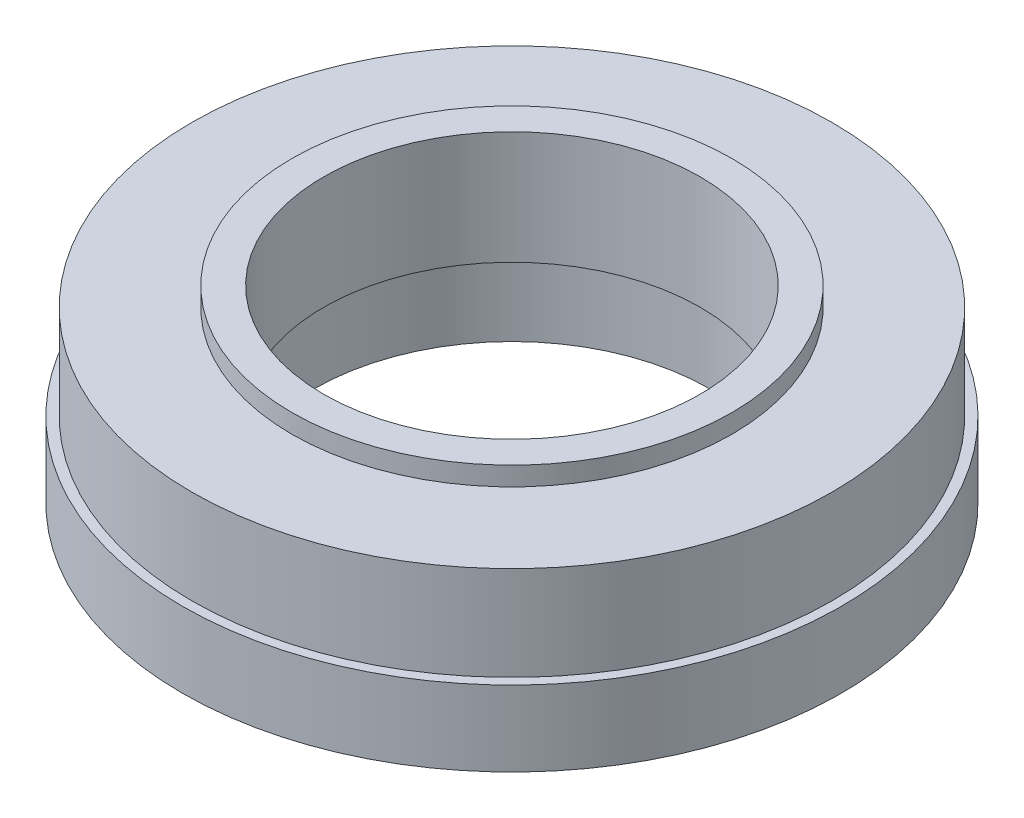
ISO-10303-21;
HEADER;
FILE_DESCRIPTION(('STEP AP214'),'2;1');
FILE_NAME('part.step','',(''),(''),'','','');
FILE_SCHEMA(('AUTOMOTIVE_DESIGN { 1 0 10303 214 1 1 1 1 }'));
ENDSEC;
DATA;
#1=APPLICATION_CONTEXT('core data for automotive mechanical design processes');
#2=APPLICATION_PROTOCOL_DEFINITION('international standard','automotive_design',2000,#1);
#3=PRODUCT_CONTEXT('',#1,'mechanical');
#4=PRODUCT('Part','Part','',(#3));
#5=PRODUCT_RELATED_PRODUCT_CATEGORY('part','',(#4));
#6=PRODUCT_DEFINITION_FORMATION('','',#4);
#7=PRODUCT_DEFINITION_CONTEXT('part definition',#1,'design');
#8=PRODUCT_DEFINITION('design','',#6,#7);
#9=PRODUCT_DEFINITION_SHAPE('','',#8);
#10=(LENGTH_UNIT() NAMED_UNIT(*) SI_UNIT(.MILLI.,.METRE.));
#11=(NAMED_UNIT(*) PLANE_ANGLE_UNIT() SI_UNIT($,.RADIAN.));
#12=(NAMED_UNIT(*) SI_UNIT($,.STERADIAN.) SOLID_ANGLE_UNIT());
#13=UNCERTAINTY_MEASURE_WITH_UNIT(LENGTH_MEASURE(1.E-05),#10,'distance_accuracy_value','');
#14=(GEOMETRIC_REPRESENTATION_CONTEXT(3) GLOBAL_UNCERTAINTY_ASSIGNED_CONTEXT((#13)) GLOBAL_UNIT_ASSIGNED_CONTEXT((#10,
#11,#12)) REPRESENTATION_CONTEXT('',''));
#15=CARTESIAN_POINT('',(0.,0.,0.));
#16=DIRECTION('',(0.,0.,1.));
#17=DIRECTION('',(1.,0.,0.));
#18=AXIS2_PLACEMENT_3D('',#15,#16,#17);
#19=CARTESIAN_POINT('',(0.,9.,0.));
#20=DIRECTION('',(0.,1.,0.));
#21=DIRECTION('',(0.,0.,1.));
#22=AXIS2_PLACEMENT_3D('',#19,#20,#21);
#23=PLANE('',#22);
#24=CARTESIAN_POINT('',(0.,9.,0.));
#25=DIRECTION('',(0.,1.,0.));
#26=DIRECTION('',(0.,0.,1.));
#27=AXIS2_PLACEMENT_3D('',#24,#25,#26);
#28=CIRCLE('',#27,17.);
#29=CARTESIAN_POINT('',(0.,9.,17.));
#30=VERTEX_POINT('',#29);
#31=EDGE_CURVE('E60',#30,#30,#28,.T.);
#32=ORIENTED_EDGE('',*,*,#31,.T.);
#33=EDGE_LOOP('',(#32));
#34=FACE_BOUND('',#33,.T.);
#35=CARTESIAN_POINT('',(0.,9.,0.));
#36=DIRECTION('',(0.,1.,0.));
#37=DIRECTION('',(0.,0.,1.));
#38=AXIS2_PLACEMENT_3D('',#35,#36,#37);
#39=CIRCLE('',#38,11.684);
#40=CARTESIAN_POINT('',(0.,9.,11.684));
#41=VERTEX_POINT('',#40);
#42=EDGE_CURVE('E66',#41,#41,#39,.T.);
#43=ORIENTED_EDGE('',*,*,#42,.F.);
#44=EDGE_LOOP('',(#43));
#45=FACE_BOUND('',#44,.T.);
#46=ADVANCED_FACE('F34',(#34,#45),#23,.T.);
#47=CARTESIAN_POINT('',(0.,4.,0.));
#48=DIRECTION('',(0.,1.,0.));
#49=DIRECTION('',(0.,0.,1.));
#50=AXIS2_PLACEMENT_3D('',#47,#48,#49);
#51=PLANE('',#50);
#52=CARTESIAN_POINT('',(0.,4.,0.));
#53=DIRECTION('',(0.,1.,0.));
#54=DIRECTION('',(0.,0.,1.));
#55=AXIS2_PLACEMENT_3D('',#52,#53,#54);
#56=CIRCLE('',#55,17.5);
#57=CARTESIAN_POINT('',(0.,4.,17.5));
#58=VERTEX_POINT('',#57);
#59=EDGE_CURVE('E10',#58,#58,#56,.T.);
#60=ORIENTED_EDGE('',*,*,#59,.T.);
#61=EDGE_LOOP('',(#60));
#62=FACE_BOUND('',#61,.T.);
#63=CARTESIAN_POINT('',(0.,4.,0.));
#64=DIRECTION('',(0.,1.,0.));
#65=DIRECTION('',(0.,0.,1.));
#66=AXIS2_PLACEMENT_3D('',#63,#64,#65);
#67=CIRCLE('',#66,17.);
#68=CARTESIAN_POINT('',(0.,4.,17.));
#69=VERTEX_POINT('',#68);
#70=EDGE_CURVE('E54',#69,#69,#67,.T.);
#71=ORIENTED_EDGE('',*,*,#70,.F.);
#72=EDGE_LOOP('',(#71));
#73=FACE_BOUND('',#72,.T.);
#74=ADVANCED_FACE('F90',(#62,#73),#51,.T.);
#75=CARTESIAN_POINT('',(0.,0.,0.));
#76=DIRECTION('',(0.,1.,0.));
#77=DIRECTION('',(0.,0.,1.));
#78=AXIS2_PLACEMENT_3D('',#75,#76,#77);
#79=PLANE('',#78);
#80=CARTESIAN_POINT('',(0.,0.,0.));
#81=DIRECTION('',(0.,1.,0.));
#82=DIRECTION('',(0.,0.,1.));
#83=AXIS2_PLACEMENT_3D('',#80,#81,#82);
#84=CIRCLE('',#83,17.5);
#85=CARTESIAN_POINT('',(0.,0.,17.5));
#86=VERTEX_POINT('',#85);
#87=EDGE_CURVE('E41',#86,#86,#84,.T.);
#88=ORIENTED_EDGE('',*,*,#87,.F.);
#89=EDGE_LOOP('',(#88));
#90=FACE_BOUND('',#89,.T.);
#91=CARTESIAN_POINT('',(0.,0.,0.));
#92=DIRECTION('',(0.,1.,0.));
#93=DIRECTION('',(0.,0.,1.));
#94=AXIS2_PLACEMENT_3D('',#91,#92,#93);
#95=CIRCLE('',#94,10.5);
#96=CARTESIAN_POINT('',(0.,0.,10.5));
#97=VERTEX_POINT('',#96);
#98=EDGE_CURVE('E45',#97,#97,#95,.T.);
#99=ORIENTED_EDGE('',*,*,#98,.T.);
#100=EDGE_LOOP('',(#99));
#101=FACE_BOUND('',#100,.T.);
#102=ADVANCED_FACE('F96',(#90,#101),#79,.F.);
#103=CARTESIAN_POINT('',(0.,4.,0.));
#104=DIRECTION('',(0.,-1.,0.));
#105=DIRECTION('',(0.,0.,-1.));
#106=AXIS2_PLACEMENT_3D('',#103,#104,#105);
#107=CYLINDRICAL_SURFACE('',#106,17.5);
#108=ORIENTED_EDGE('',*,*,#59,.F.);
#109=EDGE_LOOP('',(#108));
#110=FACE_BOUND('',#109,.T.);
#111=ORIENTED_EDGE('',*,*,#87,.T.);
#112=EDGE_LOOP('',(#111));
#113=FACE_BOUND('',#112,.T.);
#114=ADVANCED_FACE('F36',(#110,#113),#107,.T.);
#115=CARTESIAN_POINT('',(0.,4.,0.));
#116=DIRECTION('',(0.,-1.,0.));
#117=DIRECTION('',(0.,0.,-1.));
#118=AXIS2_PLACEMENT_3D('',#115,#116,#117);
#119=CYLINDRICAL_SURFACE('',#118,10.5);
#120=CARTESIAN_POINT('',(0.,4.,0.));
#121=DIRECTION('',(0.,1.,0.));
#122=DIRECTION('',(0.,0.,1.));
#123=AXIS2_PLACEMENT_3D('',#120,#121,#122);
#124=CIRCLE('',#123,10.5);
#125=CARTESIAN_POINT('',(0.,4.,10.5));
#126=VERTEX_POINT('',#125);
#127=EDGE_CURVE('E49',#126,#126,#124,.T.);
#128=ORIENTED_EDGE('',*,*,#127,.T.);
#129=EDGE_LOOP('',(#128));
#130=FACE_BOUND('',#129,.T.);
#131=ORIENTED_EDGE('',*,*,#98,.F.);
#132=EDGE_LOOP('',(#131));
#133=FACE_BOUND('',#132,.T.);
#134=ADVANCED_FACE('F102',(#130,#133),#119,.F.);
#135=CARTESIAN_POINT('',(0.,4.,0.));
#136=DIRECTION('',(0.,1.,0.));
#137=DIRECTION('',(0.,0.,1.));
#138=AXIS2_PLACEMENT_3D('',#135,#136,#137);
#139=PLANE('',#138);
#140=ORIENTED_EDGE('',*,*,#127,.F.);
#141=EDGE_LOOP('',(#140));
#142=FACE_BOUND('',#141,.T.);
#143=CARTESIAN_POINT('',(0.,4.,0.));
#144=DIRECTION('',(0.,1.,0.));
#145=DIRECTION('',(0.,0.,1.));
#146=AXIS2_PLACEMENT_3D('',#143,#144,#145);
#147=CIRCLE('',#146,10.);
#148=CARTESIAN_POINT('',(0.,4.,10.));
#149=VERTEX_POINT('',#148);
#150=EDGE_CURVE('E57',#149,#149,#147,.T.);
#151=ORIENTED_EDGE('',*,*,#150,.T.);
#152=EDGE_LOOP('',(#151));
#153=FACE_BOUND('',#152,.T.);
#154=ADVANCED_FACE('F99',(#142,#153),#139,.F.);
#155=CARTESIAN_POINT('',(0.,6.,0.));
#156=DIRECTION('',(0.,-1.,0.));
#157=DIRECTION('',(0.,0.,-1.));
#158=AXIS2_PLACEMENT_3D('',#155,#156,#157);
#159=CYLINDRICAL_SURFACE('',#158,17.);
#160=ORIENTED_EDGE('',*,*,#70,.T.);
#161=EDGE_LOOP('',(#160));
#162=FACE_BOUND('',#161,.T.);
#163=ORIENTED_EDGE('',*,*,#31,.F.);
#164=EDGE_LOOP('',(#163));
#165=FACE_BOUND('',#164,.T.);
#166=ADVANCED_FACE('F86',(#162,#165),#159,.T.);
#167=CARTESIAN_POINT('',(0.,6.,0.));
#168=DIRECTION('',(0.,-1.,0.));
#169=DIRECTION('',(0.,0.,-1.));
#170=AXIS2_PLACEMENT_3D('',#167,#168,#169);
#171=CYLINDRICAL_SURFACE('',#170,10.);
#172=ORIENTED_EDGE('',*,*,#150,.F.);
#173=EDGE_LOOP('',(#172));
#174=FACE_BOUND('',#173,.T.);
#175=CARTESIAN_POINT('',(0.,10.,0.));
#176=DIRECTION('',(0.,1.,0.));
#177=DIRECTION('',(0.,0.,1.));
#178=AXIS2_PLACEMENT_3D('',#175,#176,#177);
#179=CIRCLE('',#178,10.);
#180=CARTESIAN_POINT('',(0.,10.,10.));
#181=VERTEX_POINT('',#180);
#182=EDGE_CURVE('E69',#181,#181,#179,.T.);
#183=ORIENTED_EDGE('',*,*,#182,.T.);
#184=EDGE_LOOP('',(#183));
#185=FACE_BOUND('',#184,.T.);
#186=ADVANCED_FACE('F73',(#174,#185),#171,.F.);
#187=CARTESIAN_POINT('',(0.,10.,0.));
#188=DIRECTION('',(0.,1.,0.));
#189=DIRECTION('',(0.,0.,1.));
#190=AXIS2_PLACEMENT_3D('',#187,#188,#189);
#191=PLANE('',#190);
#192=CARTESIAN_POINT('',(0.,10.,0.));
#193=DIRECTION('',(0.,1.,0.));
#194=DIRECTION('',(0.,0.,1.));
#195=AXIS2_PLACEMENT_3D('',#192,#193,#194);
#196=CIRCLE('',#195,11.684);
#197=CARTESIAN_POINT('',(0.,10.,11.684));
#198=VERTEX_POINT('',#197);
#199=EDGE_CURVE('E63',#198,#198,#196,.T.);
#200=ORIENTED_EDGE('',*,*,#199,.T.);
#201=EDGE_LOOP('',(#200));
#202=FACE_BOUND('',#201,.T.);
#203=ORIENTED_EDGE('',*,*,#182,.F.);
#204=EDGE_LOOP('',(#203));
#205=FACE_BOUND('',#204,.T.);
#206=ADVANCED_FACE('F75',(#202,#205),#191,.T.);
#207=CARTESIAN_POINT('',(0.,10.,0.));
#208=DIRECTION('',(0.,-1.,0.));
#209=DIRECTION('',(0.,0.,-1.));
#210=AXIS2_PLACEMENT_3D('',#207,#208,#209);
#211=CYLINDRICAL_SURFACE('',#210,11.684);
#212=ORIENTED_EDGE('',*,*,#199,.F.);
#213=EDGE_LOOP('',(#212));
#214=FACE_BOUND('',#213,.T.);
#215=ORIENTED_EDGE('',*,*,#42,.T.);
#216=EDGE_LOOP('',(#215));
#217=FACE_BOUND('',#216,.T.);
#218=ADVANCED_FACE('F77',(#214,#217),#211,.T.);
#219=CLOSED_SHELL('',(#46,#74,#102,#114,#134,#154,#166,#186,#206,#218));
#220=MANIFOLD_SOLID_BREP('B2',#219);
#221=ADVANCED_BREP_SHAPE_REPRESENTATION('',(#18,#220),#14);
#222=SHAPE_DEFINITION_REPRESENTATION(#9,#221);
ENDSEC;
END-ISO-10303-21;
